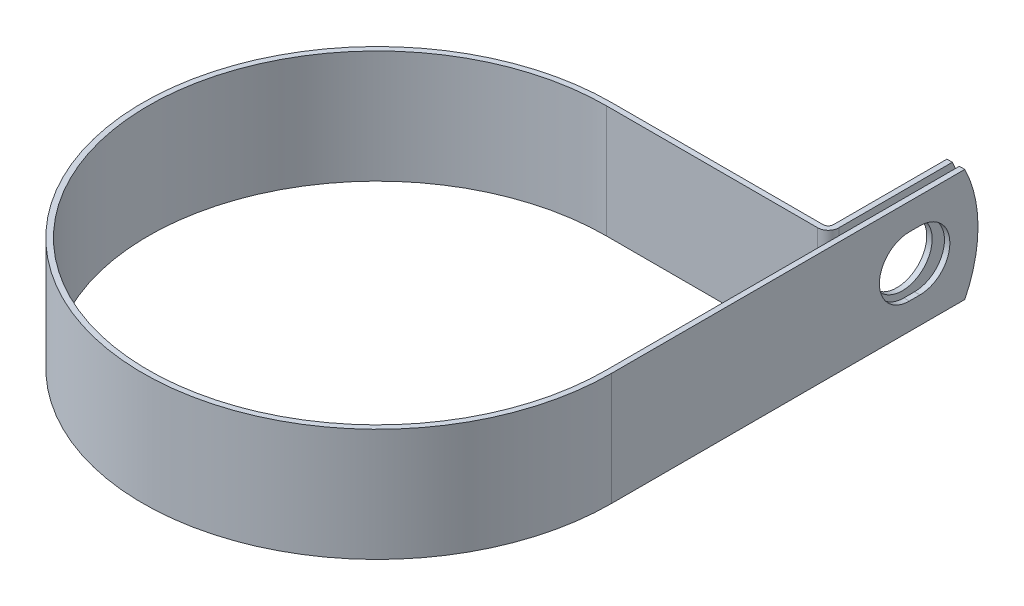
from build123d import *

# Parameters (mm, degrees)
EXTRUDE_THIN1_DEPTH = 12.7
SKETCH2_R           = 6.7437
CUT_EXTRUDE1_DEPTH  = 1.2192
CUT_EXTRUDE2_REACH  = 136.632
CUT_EXTRUDE3_DEPTH  = 132.507260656


with BuildPart() as part:
    # Sketch1 → Extrude-Thin1 (new, symmetric)
    with BuildSketch(Plane(origin=(0, 0, 0), x_dir=(1, 0, 0), z_dir=(0, 1, 0))):
        with BuildLine():
            Line((51.5874, 82.5246), (51.5874, 51.5874))
            Line((51.5874, 51.5874), (51.5874, 0))
            ThreePointArc((51.5874, 0), (-36.477800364, -36.477800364), (0, 51.5874))
            Line((0, 51.5874), (47.63516, 51.5874))
            ThreePointArc((47.63516, 51.5874), (49.316263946, 52.283736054), (50.0126, 53.96484))
            Line((50.0126, 53.96484), (50.0126, 82.5246))
            Line((50.0126, 82.5246), (48.7934, 82.5246))
            Line((48.7934, 82.5246), (48.7934, 53.96484))
            ThreePointArc((48.7934, 53.96484), (48.454159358, 53.145840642), (47.63516, 52.8066))
            Line((47.63516, 52.8066), (0, 52.8066))
            ThreePointArc((0, 52.8066), (-37.339904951, -37.339904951), (52.8066, 0))
            Line((52.8066, 0), (52.8066, 51.5874))
            Line((52.8066, 51.5874), (52.8066, 82.5246))
            Line((52.8066, 82.5246), (51.5874, 82.5246))
        make_face()
    extrude(amount=EXTRUDE_THIN1_DEPTH, both=True)

    # Sketch2 → Cut-Extrude1 (cut)
    with BuildSketch(Plane.ZY.offset(-48.7934)):
        with Locations((-68.2498, 0)):
            Circle(SKETCH2_R)
    extrude(amount=-CUT_EXTRUDE1_DEPTH, mode=Mode.SUBTRACT)

    # Sketch3 → Cut-Extrude2 (cut, up to next)
    with BuildSketch(Plane(origin=(52.8066, 0, 0), x_dir=(0, 0, -1), z_dir=(1, 0, 0)), mode=Mode.PRIVATE) as cut_extrude2_sk1:
        with BuildLine():
            Line((67.056, 6.7437), (69.4436, 6.7437))
            ThreePointArc((69.4436, 6.7437), (76.1873, 0), (69.4436, -6.7437))
            Line((69.4436, -6.7437), (67.056, -6.7437))
            ThreePointArc((67.056, -6.7437), (60.3123, 0), (67.056, 6.7437))
        make_face()
    cut_extrude2_tool1 = extrude(cut_extrude2_sk1.sketch, amount=-CUT_EXTRUDE2_REACH, mode=Mode.PRIVATE) & part.part
    add(cut_extrude2_tool1.solids().sort_by_distance((52.8066, 0, -68.2498))[0], mode=Mode.SUBTRACT)

    # Sketch4 → Cut-Extrude3 (cut, through all)
    with BuildSketch(Plane.ZY.offset(-48.7934)):
        with BuildLine():
            Line((-79.547268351, 12.7), (-82.5246, 12.7))
            Line((-82.5246, 12.7), (-82.5246, 0))
            ThreePointArc((-82.5246, 0), (-81.770311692, 6.522164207), (-79.547268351, 12.7))
        make_face()
        with BuildLine():
            ThreePointArc((-79.547268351, -12.7), (-81.770311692, -6.522164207), (-82.5246, 0))
            Line((-82.5246, 0), (-82.5246, -12.7))
            Line((-82.5246, -12.7), (-79.547268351, -12.7))
        make_face()
    extrude(amount=-CUT_EXTRUDE3_DEPTH, mode=Mode.SUBTRACT)


solid = part.part
